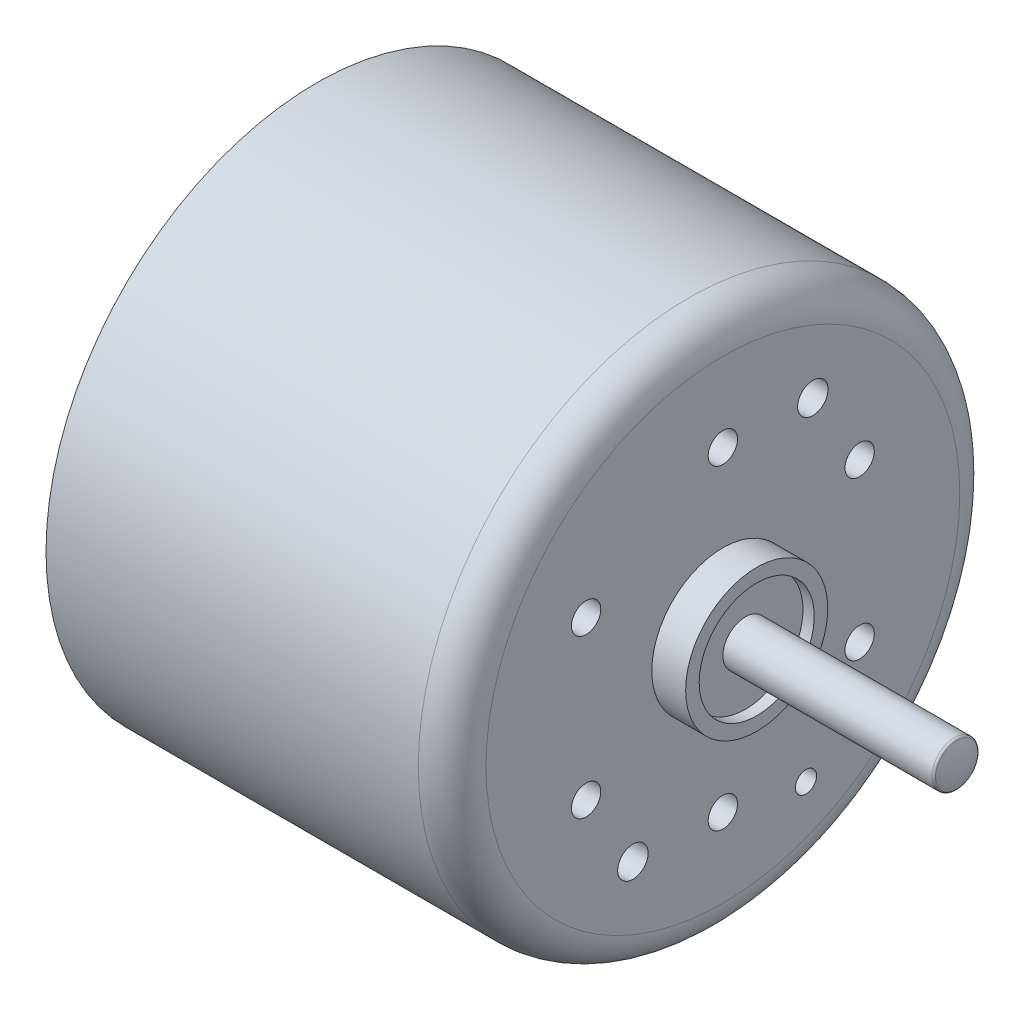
ISO-10303-21;
HEADER;
FILE_DESCRIPTION(('STEP AP214'),'2;1');
FILE_NAME('part.step','',(''),(''),'','','');
FILE_SCHEMA(('AUTOMOTIVE_DESIGN { 1 0 10303 214 1 1 1 1 }'));
ENDSEC;
DATA;
#1=APPLICATION_CONTEXT('core data for automotive mechanical design processes');
#2=APPLICATION_PROTOCOL_DEFINITION('international standard','automotive_design',2000,#1);
#3=PRODUCT_CONTEXT('',#1,'mechanical');
#4=PRODUCT('Part','Part','',(#3));
#5=PRODUCT_RELATED_PRODUCT_CATEGORY('part','',(#4));
#6=PRODUCT_DEFINITION_FORMATION('','',#4);
#7=PRODUCT_DEFINITION_CONTEXT('part definition',#1,'design');
#8=PRODUCT_DEFINITION('design','',#6,#7);
#9=PRODUCT_DEFINITION_SHAPE('','',#8);
#10=(LENGTH_UNIT() NAMED_UNIT(*) SI_UNIT(.MILLI.,.METRE.));
#11=(NAMED_UNIT(*) PLANE_ANGLE_UNIT() SI_UNIT($,.RADIAN.));
#12=(NAMED_UNIT(*) SI_UNIT($,.STERADIAN.) SOLID_ANGLE_UNIT());
#13=UNCERTAINTY_MEASURE_WITH_UNIT(LENGTH_MEASURE(1.E-05),#10,'distance_accuracy_value','');
#14=(GEOMETRIC_REPRESENTATION_CONTEXT(3) GLOBAL_UNCERTAINTY_ASSIGNED_CONTEXT((#13)) GLOBAL_UNIT_ASSIGNED_CONTEXT((#10,
#11,#12)) REPRESENTATION_CONTEXT('',''));
#15=CARTESIAN_POINT('',(0.,0.,0.));
#16=DIRECTION('',(0.,0.,1.));
#17=DIRECTION('',(1.,0.,0.));
#18=AXIS2_PLACEMENT_3D('',#15,#16,#17);
#19=CARTESIAN_POINT('',(30.268447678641,0.,0.));
#20=DIRECTION('',(-1.,0.,0.));
#21=DIRECTION('',(0.,0.,1.));
#22=AXIS2_PLACEMENT_3D('',#19,#20,#21);
#23=TOROIDAL_SURFACE('',#22,0.900000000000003,0.100000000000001);
#24=CARTESIAN_POINT('',(30.3623738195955,0.,0.));
#25=DIRECTION('',(-1.,0.,0.));
#26=DIRECTION('',(0.,0.,1.));
#27=AXIS2_PLACEMENT_3D('',#24,#25,#26);
#28=CIRCLE('',#27,0.934320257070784);
#29=CARTESIAN_POINT('',(30.3623738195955,0.,0.934320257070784));
#30=VERTEX_POINT('',#29);
#31=EDGE_CURVE('E11',#30,#30,#28,.T.);
#32=ORIENTED_EDGE('',*,*,#31,.T.);
#33=EDGE_LOOP('',(#32));
#34=FACE_BOUND('',#33,.T.);
#35=CARTESIAN_POINT('',(30.268447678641,0.,0.));
#36=DIRECTION('',(-1.,0.,0.));
#37=DIRECTION('',(0.,0.,1.));
#38=AXIS2_PLACEMENT_3D('',#35,#36,#37);
#39=CIRCLE('',#38,1.);
#40=CARTESIAN_POINT('',(30.268447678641,0.,1.));
#41=VERTEX_POINT('',#40);
#42=EDGE_CURVE('E46',#41,#41,#39,.T.);
#43=ORIENTED_EDGE('',*,*,#42,.F.);
#44=EDGE_LOOP('',(#43));
#45=FACE_BOUND('',#44,.T.);
#46=ADVANCED_FACE('F27',(#34,#45),#23,.T.);
#47=CARTESIAN_POINT('',(28.1738982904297,0.,0.134659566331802));
#48=DIRECTION('',(0.,-1.,0.));
#49=DIRECTION('',(0.,0.,1.));
#50=AXIS2_PLACEMENT_3D('',#47,#48,#49);
#51=CIRCLE('',#50,2.32999621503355);
#52=TRIMMED_CURVE('',#51,(PARAMETER_VALUE(-1.62862244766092)),
(PARAMETER_VALUE(1.62862244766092)),.T.,.PARAMETER.);
#53=CARTESIAN_POINT('',(28.1738982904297,0.,0.));
#54=DIRECTION('',(-1.,0.,0.));
#55=AXIS1_PLACEMENT('',#53,#54);
#56=SURFACE_OF_REVOLUTION('',#52,#55);
#57=CARTESIAN_POINT('',(30.5,0.,0.));
#58=VERTEX_POINT('',#57);
#59=VERTEX_LOOP('',#58);
#60=FACE_BOUND('',#59,.T.);
#61=ORIENTED_EDGE('',*,*,#31,.F.);
#62=EDGE_LOOP('',(#61));
#63=FACE_BOUND('',#62,.T.);
#64=ADVANCED_FACE('F36',(#60,#63),#56,.T.);
#65=CARTESIAN_POINT('',(0.,2.83104480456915,0.));
#66=DIRECTION('',(1.,0.,0.));
#67=DIRECTION('',(0.,0.,-1.));
#68=AXIS2_PLACEMENT_3D('',#65,#66,#67);
#69=PLANE('',#68);
#70=CARTESIAN_POINT('',(0.,0.,0.));
#71=DIRECTION('',(-1.,0.,0.));
#72=DIRECTION('',(0.,0.,1.));
#73=AXIS2_PLACEMENT_3D('',#70,#71,#72);
#74=CIRCLE('',#73,0.87340055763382);
#75=CARTESIAN_POINT('',(0.,0.,0.87340055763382));
#76=VERTEX_POINT('',#75);
#77=EDGE_CURVE('E33',#76,#76,#74,.T.);
#78=ORIENTED_EDGE('',*,*,#77,.T.);
#79=EDGE_LOOP('',(#78));
#80=FACE_BOUND('',#79,.T.);
#81=ADVANCED_FACE('F39',(#80),#69,.F.);
#82=CARTESIAN_POINT('',(5.38600510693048,0.,0.));
#83=DIRECTION('',(-1.,0.,0.));
#84=DIRECTION('',(0.,0.,1.));
#85=AXIS2_PLACEMENT_3D('',#82,#83,#84);
#86=DEGENERATE_TOROIDAL_SURFACE('',#85,0.436700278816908,5.4036800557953,.T.);
#87=CARTESIAN_POINT('',(0.592327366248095,0.,0.));
#88=DIRECTION('',(-1.,0.,0.));
#89=DIRECTION('',(0.,0.,1.));
#90=AXIS2_PLACEMENT_3D('',#87,#88,#89);
#91=CIRCLE('',#90,2.93077563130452);
#92=CARTESIAN_POINT('',(0.592327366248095,0.,2.93077563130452));
#93=VERTEX_POINT('',#92);
#94=EDGE_CURVE('E91',#93,#93,#91,.T.);
#95=ORIENTED_EDGE('',*,*,#94,.T.);
#96=EDGE_LOOP('',(#95));
#97=FACE_BOUND('',#96,.T.);
#98=ORIENTED_EDGE('',*,*,#77,.F.);
#99=EDGE_LOOP('',(#98));
#100=FACE_BOUND('',#99,.T.);
#101=ADVANCED_FACE('F97',(#97,#100),#86,.T.);
#102=CARTESIAN_POINT('',(1.03588413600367,0.,0.));
#103=DIRECTION('',(-1.,0.,0.));
#104=DIRECTION('',(0.,0.,1.));
#105=AXIS2_PLACEMENT_3D('',#102,#103,#104);
#106=TOROIDAL_SURFACE('',#105,2.7,0.5);
#107=ORIENTED_EDGE('',*,*,#94,.F.);
#108=EDGE_LOOP('',(#107));
#109=FACE_BOUND('',#108,.T.);
#110=CARTESIAN_POINT('',(1.03588413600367,0.,0.));
#111=DIRECTION('',(-1.,0.,0.));
#112=DIRECTION('',(0.,0.,1.));
#113=AXIS2_PLACEMENT_3D('',#110,#111,#112);
#114=CIRCLE('',#113,3.2);
#115=CARTESIAN_POINT('',(1.03588413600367,0.,3.2));
#116=VERTEX_POINT('',#115);
#117=EDGE_CURVE('E88',#116,#116,#114,.T.);
#118=ORIENTED_EDGE('',*,*,#117,.T.);
#119=EDGE_LOOP('',(#118));
#120=FACE_BOUND('',#119,.T.);
#121=ADVANCED_FACE('F99',(#109,#120),#106,.T.);
#122=CARTESIAN_POINT('',(0.,0.,0.));
#123=DIRECTION('',(-1.,0.,0.));
#124=DIRECTION('',(0.,0.,1.));
#125=AXIS2_PLACEMENT_3D('',#122,#123,#124);
#126=CYLINDRICAL_SURFACE('',#125,3.2);
#127=ORIENTED_EDGE('',*,*,#117,.F.);
#128=EDGE_LOOP('',(#127));
#129=FACE_BOUND('',#128,.T.);
#130=CARTESIAN_POINT('',(2.5,0.,0.));
#131=DIRECTION('',(-1.,0.,0.));
#132=DIRECTION('',(0.,0.,1.));
#133=AXIS2_PLACEMENT_3D('',#130,#131,#132);
#134=CIRCLE('',#133,3.2);
#135=CARTESIAN_POINT('',(2.5,0.,3.2));
#136=VERTEX_POINT('',#135);
#137=EDGE_CURVE('E85',#136,#136,#134,.T.);
#138=ORIENTED_EDGE('',*,*,#137,.T.);
#139=EDGE_LOOP('',(#138));
#140=FACE_BOUND('',#139,.T.);
#141=ADVANCED_FACE('F106',(#129,#140),#126,.T.);
#142=CARTESIAN_POINT('',(2.5,2.83104480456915,0.));
#143=DIRECTION('',(1.,0.,0.));
#144=DIRECTION('',(0.,0.,-1.));
#145=AXIS2_PLACEMENT_3D('',#142,#143,#144);
#146=PLANE('',#145);
#147=ORIENTED_EDGE('',*,*,#137,.F.);
#148=EDGE_LOOP('',(#147));
#149=FACE_BOUND('',#148,.T.);
#150=CARTESIAN_POINT('',(2.5,0.,0.));
#151=DIRECTION('',(-1.,0.,0.));
#152=DIRECTION('',(0.,0.,1.));
#153=AXIS2_PLACEMENT_3D('',#150,#151,#152);
#154=CIRCLE('',#153,11.4);
#155=CARTESIAN_POINT('',(2.5,0.,11.4));
#156=VERTEX_POINT('',#155);
#157=EDGE_CURVE('E82',#156,#156,#154,.T.);
#158=ORIENTED_EDGE('',*,*,#157,.T.);
#159=EDGE_LOOP('',(#158));
#160=FACE_BOUND('',#159,.T.);
#161=ADVANCED_FACE('F113',(#149,#160),#146,.F.);
#162=CARTESIAN_POINT('',(0.,0.,0.));
#163=DIRECTION('',(-1.,0.,0.));
#164=DIRECTION('',(0.,0.,1.));
#165=AXIS2_PLACEMENT_3D('',#162,#163,#164);
#166=CYLINDRICAL_SURFACE('',#165,11.4);
#167=ORIENTED_EDGE('',*,*,#157,.F.);
#168=EDGE_LOOP('',(#167));
#169=FACE_BOUND('',#168,.T.);
#170=CARTESIAN_POINT('',(2.,0.,0.));
#171=DIRECTION('',(-1.,0.,0.));
#172=DIRECTION('',(0.,0.,1.));
#173=AXIS2_PLACEMENT_3D('',#170,#171,#172);
#174=CIRCLE('',#173,11.4);
#175=CARTESIAN_POINT('',(2.,0.,11.4));
#176=VERTEX_POINT('',#175);
#177=EDGE_CURVE('E79',#176,#176,#174,.T.);
#178=ORIENTED_EDGE('',*,*,#177,.T.);
#179=EDGE_LOOP('',(#178));
#180=FACE_BOUND('',#179,.T.);
#181=ADVANCED_FACE('F117',(#169,#180),#166,.F.);
#182=CARTESIAN_POINT('',(2.,2.83104480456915,0.));
#183=DIRECTION('',(1.,0.,0.));
#184=DIRECTION('',(0.,0.,-1.));
#185=AXIS2_PLACEMENT_3D('',#182,#183,#184);
#186=PLANE('',#185);
#187=ORIENTED_EDGE('',*,*,#177,.F.);
#188=EDGE_LOOP('',(#187));
#189=FACE_BOUND('',#188,.T.);
#190=CARTESIAN_POINT('',(2.,0.,0.));
#191=DIRECTION('',(-1.,0.,0.));
#192=DIRECTION('',(0.,0.,1.));
#193=AXIS2_PLACEMENT_3D('',#190,#191,#192);
#194=CIRCLE('',#193,12.);
#195=CARTESIAN_POINT('',(2.,0.,12.));
#196=VERTEX_POINT('',#195);
#197=EDGE_CURVE('E76',#196,#196,#194,.T.);
#198=ORIENTED_EDGE('',*,*,#197,.T.);
#199=EDGE_LOOP('',(#198));
#200=FACE_BOUND('',#199,.T.);
#201=ADVANCED_FACE('F121',(#189,#200),#186,.F.);
#202=CARTESIAN_POINT('',(0.,0.,0.));
#203=DIRECTION('',(-1.,0.,0.));
#204=DIRECTION('',(0.,0.,1.));
#205=AXIS2_PLACEMENT_3D('',#202,#203,#204);
#206=CYLINDRICAL_SURFACE('',#205,12.);
#207=ORIENTED_EDGE('',*,*,#197,.F.);
#208=EDGE_LOOP('',(#207));
#209=FACE_BOUND('',#208,.T.);
#210=CARTESIAN_POINT('',(18.5,0.,0.));
#211=DIRECTION('',(-1.,0.,0.));
#212=DIRECTION('',(0.,0.,1.));
#213=AXIS2_PLACEMENT_3D('',#210,#211,#212);
#214=CIRCLE('',#213,12.);
#215=CARTESIAN_POINT('',(18.5,0.,12.));
#216=VERTEX_POINT('',#215);
#217=EDGE_CURVE('E73',#216,#216,#214,.T.);
#218=ORIENTED_EDGE('',*,*,#217,.T.);
#219=EDGE_LOOP('',(#218));
#220=FACE_BOUND('',#219,.T.);
#221=ADVANCED_FACE('F125',(#209,#220),#206,.T.);
#222=CARTESIAN_POINT('',(18.5,0.,0.));
#223=DIRECTION('',(-1.,0.,0.));
#224=DIRECTION('',(0.,0.,1.));
#225=AXIS2_PLACEMENT_3D('',#222,#223,#224);
#226=TOROIDAL_SURFACE('',#225,10.5,1.5);
#227=CARTESIAN_POINT('',(20.,0.,0.));
#228=DIRECTION('',(-1.,0.,0.));
#229=DIRECTION('',(0.,0.,1.));
#230=AXIS2_PLACEMENT_3D('',#227,#228,#229);
#231=CIRCLE('',#230,10.5);
#232=CARTESIAN_POINT('',(20.,0.,10.5));
#233=VERTEX_POINT('',#232);
#234=EDGE_CURVE('E70',#233,#233,#231,.T.);
#235=ORIENTED_EDGE('',*,*,#234,.T.);
#236=EDGE_LOOP('',(#235));
#237=FACE_BOUND('',#236,.T.);
#238=ORIENTED_EDGE('',*,*,#217,.F.);
#239=EDGE_LOOP('',(#238));
#240=FACE_BOUND('',#239,.T.);
#241=ADVANCED_FACE('F129',(#237,#240),#226,.T.);
#242=CARTESIAN_POINT('',(20.,2.83104480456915,0.));
#243=DIRECTION('',(-1.,0.,0.));
#244=DIRECTION('',(0.,0.,1.));
#245=AXIS2_PLACEMENT_3D('',#242,#243,#244);
#246=PLANE('',#245);
#247=CARTESIAN_POINT('',(20.,-7.67489330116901,-3.68322302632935));
#248=DIRECTION('',(1.,0.,0.));
#249=DIRECTION('',(0.,0.,-1.));
#250=AXIS2_PLACEMENT_3D('',#247,#248,#249);
#251=CIRCLE('',#250,0.471742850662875);
#252=CARTESIAN_POINT('',(20.,-7.67489330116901,-4.15496587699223));
#253=VERTEX_POINT('',#252);
#254=EDGE_CURVE('E235',#253,#253,#251,.T.);
#255=ORIENTED_EDGE('',*,*,#254,.F.);
#256=EDGE_LOOP('',(#255));
#257=FACE_BOUND('',#256,.T.);
#258=CARTESIAN_POINT('',(20.,-6.9065525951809,3.98749999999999));
#259=DIRECTION('',(1.,0.,0.));
#260=DIRECTION('',(0.,0.,1.));
#261=AXIS2_PLACEMENT_3D('',#258,#259,#260);
#262=CIRCLE('',#261,0.675);
#263=CARTESIAN_POINT('',(20.,-6.9065525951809,4.66249999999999));
#264=VERTEX_POINT('',#263);
#265=EDGE_CURVE('E234',#264,#264,#262,.T.);
#266=ORIENTED_EDGE('',*,*,#265,.F.);
#267=EDGE_LOOP('',(#266));
#268=FACE_BOUND('',#267,.T.);
#269=CARTESIAN_POINT('',(20.,6.9065525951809,-3.9875));
#270=DIRECTION('',(1.,0.,0.));
#271=DIRECTION('',(0.,0.,-1.));
#272=AXIS2_PLACEMENT_3D('',#269,#270,#271);
#273=CIRCLE('',#272,0.675000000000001);
#274=CARTESIAN_POINT('',(20.,6.9065525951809,-4.6625));
#275=VERTEX_POINT('',#274);
#276=EDGE_CURVE('E245',#275,#275,#273,.T.);
#277=ORIENTED_EDGE('',*,*,#276,.F.);
#278=EDGE_LOOP('',(#277));
#279=FACE_BOUND('',#278,.T.);
#280=CARTESIAN_POINT('',(20.,3.50000000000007,6.06217782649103));
#281=DIRECTION('',(1.,0.,0.));
#282=DIRECTION('',(0.,0.,-1.));
#283=AXIS2_PLACEMENT_3D('',#280,#281,#282);
#284=CIRCLE('',#283,0.65);
#285=CARTESIAN_POINT('',(20.,3.50000000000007,5.41217782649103));
#286=VERTEX_POINT('',#285);
#287=EDGE_CURVE('E251',#286,#286,#284,.T.);
#288=ORIENTED_EDGE('',*,*,#287,.F.);
#289=EDGE_LOOP('',(#288));
#290=FACE_BOUND('',#289,.T.);
#291=CARTESIAN_POINT('',(20.,-3.49999999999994,6.06217782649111));
#292=DIRECTION('',(1.,0.,0.));
#293=DIRECTION('',(0.,0.,-1.));
#294=AXIS2_PLACEMENT_3D('',#291,#292,#293);
#295=CIRCLE('',#294,0.65);
#296=CARTESIAN_POINT('',(20.,-3.49999999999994,5.4121778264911));
#297=VERTEX_POINT('',#296);
#298=EDGE_CURVE('E257',#297,#297,#295,.T.);
#299=ORIENTED_EDGE('',*,*,#298,.F.);
#300=EDGE_LOOP('',(#299));
#301=FACE_BOUND('',#300,.T.);
#302=CARTESIAN_POINT('',(20.,-7.,0.));
#303=DIRECTION('',(1.,0.,0.));
#304=DIRECTION('',(0.,0.,-1.));
#305=AXIS2_PLACEMENT_3D('',#302,#303,#304);
#306=CIRCLE('',#305,0.65);
#307=CARTESIAN_POINT('',(20.,-7.,-0.649999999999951));
#308=VERTEX_POINT('',#307);
#309=EDGE_CURVE('E263',#308,#308,#306,.T.);
#310=ORIENTED_EDGE('',*,*,#309,.F.);
#311=EDGE_LOOP('',(#310));
#312=FACE_BOUND('',#311,.T.);
#313=CARTESIAN_POINT('',(20.,-3.50000000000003,-6.06217782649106));
#314=DIRECTION('',(1.,0.,0.));
#315=DIRECTION('',(0.,0.,-1.));
#316=AXIS2_PLACEMENT_3D('',#313,#314,#315);
#317=CIRCLE('',#316,0.65);
#318=CARTESIAN_POINT('',(20.,-3.50000000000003,-6.71217782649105));
#319=VERTEX_POINT('',#318);
#320=EDGE_CURVE('E269',#319,#319,#317,.T.);
#321=ORIENTED_EDGE('',*,*,#320,.F.);
#322=EDGE_LOOP('',(#321));
#323=FACE_BOUND('',#322,.T.);
#324=CARTESIAN_POINT('',(20.,3.49999999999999,-6.06217782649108));
#325=DIRECTION('',(1.,0.,0.));
#326=DIRECTION('',(0.,0.,-1.));
#327=AXIS2_PLACEMENT_3D('',#324,#325,#326);
#328=CIRCLE('',#327,0.65);
#329=CARTESIAN_POINT('',(20.,3.49999999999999,-6.71217782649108));
#330=VERTEX_POINT('',#329);
#331=EDGE_CURVE('E275',#330,#330,#328,.T.);
#332=ORIENTED_EDGE('',*,*,#331,.F.);
#333=EDGE_LOOP('',(#332));
#334=FACE_BOUND('',#333,.T.);
#335=CARTESIAN_POINT('',(20.,7.,0.));
#336=DIRECTION('',(1.,0.,0.));
#337=DIRECTION('',(0.,0.,-1.));
#338=AXIS2_PLACEMENT_3D('',#335,#336,#337);
#339=CIRCLE('',#338,0.65);
#340=CARTESIAN_POINT('',(20.,7.,-0.65));
#341=VERTEX_POINT('',#340);
#342=EDGE_CURVE('E55',#341,#341,#339,.T.);
#343=ORIENTED_EDGE('',*,*,#342,.F.);
#344=EDGE_LOOP('',(#343));
#345=FACE_BOUND('',#344,.T.);
#346=ORIENTED_EDGE('',*,*,#234,.F.);
#347=EDGE_LOOP('',(#346));
#348=FACE_BOUND('',#347,.T.);
#349=CARTESIAN_POINT('',(20.,0.,0.));
#350=DIRECTION('',(-1.,0.,0.));
#351=DIRECTION('',(0.,0.,1.));
#352=AXIS2_PLACEMENT_3D('',#349,#350,#351);
#353=CIRCLE('',#352,3.14999999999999);
#354=CARTESIAN_POINT('',(20.,0.,3.14999999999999));
#355=VERTEX_POINT('',#354);
#356=EDGE_CURVE('E67',#355,#355,#353,.T.);
#357=ORIENTED_EDGE('',*,*,#356,.T.);
#358=EDGE_LOOP('',(#357));
#359=FACE_BOUND('',#358,.T.);
#360=ADVANCED_FACE('F133',(#257,#268,#279,#290,#301,#312,#323,#334,#345,#348,#359),#246,.F.);
#361=CARTESIAN_POINT('',(0.,0.,0.));
#362=DIRECTION('',(-1.,0.,0.));
#363=DIRECTION('',(0.,0.,1.));
#364=AXIS2_PLACEMENT_3D('',#361,#362,#363);
#365=CYLINDRICAL_SURFACE('',#364,3.14999999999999);
#366=ORIENTED_EDGE('',*,*,#356,.F.);
#367=EDGE_LOOP('',(#366));
#368=FACE_BOUND('',#367,.T.);
#369=CARTESIAN_POINT('',(21.5,0.,0.));
#370=DIRECTION('',(-1.,0.,0.));
#371=DIRECTION('',(0.,0.,1.));
#372=AXIS2_PLACEMENT_3D('',#369,#370,#371);
#373=CIRCLE('',#372,3.14999999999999);
#374=CARTESIAN_POINT('',(21.5,0.,3.14999999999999));
#375=VERTEX_POINT('',#374);
#376=EDGE_CURVE('E64',#375,#375,#373,.T.);
#377=ORIENTED_EDGE('',*,*,#376,.T.);
#378=EDGE_LOOP('',(#377));
#379=FACE_BOUND('',#378,.T.);
#380=ADVANCED_FACE('F137',(#368,#379),#365,.T.);
#381=CARTESIAN_POINT('',(21.5,2.83104480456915,0.));
#382=DIRECTION('',(-1.,0.,0.));
#383=DIRECTION('',(0.,0.,1.));
#384=AXIS2_PLACEMENT_3D('',#381,#382,#383);
#385=PLANE('',#384);
#386=ORIENTED_EDGE('',*,*,#376,.F.);
#387=EDGE_LOOP('',(#386));
#388=FACE_BOUND('',#387,.T.);
#389=CARTESIAN_POINT('',(21.5,0.,0.));
#390=DIRECTION('',(-1.,0.,0.));
#391=DIRECTION('',(0.,0.,1.));
#392=AXIS2_PLACEMENT_3D('',#389,#390,#391);
#393=CIRCLE('',#392,2.54999999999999);
#394=CARTESIAN_POINT('',(21.5,0.,2.54999999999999));
#395=VERTEX_POINT('',#394);
#396=EDGE_CURVE('E61',#395,#395,#393,.T.);
#397=ORIENTED_EDGE('',*,*,#396,.T.);
#398=EDGE_LOOP('',(#397));
#399=FACE_BOUND('',#398,.T.);
#400=ADVANCED_FACE('F141',(#388,#399),#385,.F.);
#401=CARTESIAN_POINT('',(0.,0.,0.));
#402=DIRECTION('',(-1.,0.,0.));
#403=DIRECTION('',(0.,0.,1.));
#404=AXIS2_PLACEMENT_3D('',#401,#402,#403);
#405=CYLINDRICAL_SURFACE('',#404,2.54999999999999);
#406=ORIENTED_EDGE('',*,*,#396,.F.);
#407=EDGE_LOOP('',(#406));
#408=FACE_BOUND('',#407,.T.);
#409=CARTESIAN_POINT('',(21.,0.,0.));
#410=DIRECTION('',(-1.,0.,0.));
#411=DIRECTION('',(0.,0.,1.));
#412=AXIS2_PLACEMENT_3D('',#409,#410,#411);
#413=CIRCLE('',#412,2.54999999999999);
#414=CARTESIAN_POINT('',(21.,0.,2.54999999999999));
#415=VERTEX_POINT('',#414);
#416=EDGE_CURVE('E52',#415,#415,#413,.T.);
#417=ORIENTED_EDGE('',*,*,#416,.T.);
#418=EDGE_LOOP('',(#417));
#419=FACE_BOUND('',#418,.T.);
#420=ADVANCED_FACE('F145',(#408,#419),#405,.F.);
#421=CARTESIAN_POINT('',(21.,2.83104480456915,0.));
#422=DIRECTION('',(-1.,0.,0.));
#423=DIRECTION('',(0.,0.,1.));
#424=AXIS2_PLACEMENT_3D('',#421,#422,#423);
#425=PLANE('',#424);
#426=ORIENTED_EDGE('',*,*,#416,.F.);
#427=EDGE_LOOP('',(#426));
#428=FACE_BOUND('',#427,.T.);
#429=CARTESIAN_POINT('',(21.,0.,0.));
#430=DIRECTION('',(-1.,0.,0.));
#431=DIRECTION('',(0.,0.,1.));
#432=AXIS2_PLACEMENT_3D('',#429,#430,#431);
#433=CIRCLE('',#432,0.999999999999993);
#434=CARTESIAN_POINT('',(21.,0.,0.999999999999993));
#435=VERTEX_POINT('',#434);
#436=EDGE_CURVE('E48',#435,#435,#433,.T.);
#437=ORIENTED_EDGE('',*,*,#436,.T.);
#438=EDGE_LOOP('',(#437));
#439=FACE_BOUND('',#438,.T.);
#440=ADVANCED_FACE('F149',(#428,#439),#425,.F.);
#441=CARTESIAN_POINT('',(0.,0.,0.));
#442=DIRECTION('',(-1.,0.,0.));
#443=DIRECTION('',(0.,0.,1.));
#444=AXIS2_PLACEMENT_3D('',#441,#442,#443);
#445=CYLINDRICAL_SURFACE('',#444,0.999999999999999);
#446=ORIENTED_EDGE('',*,*,#436,.F.);
#447=EDGE_LOOP('',(#446));
#448=FACE_BOUND('',#447,.T.);
#449=ORIENTED_EDGE('',*,*,#42,.T.);
#450=EDGE_LOOP('',(#449));
#451=FACE_BOUND('',#450,.T.);
#452=ADVANCED_FACE('F153',(#448,#451),#445,.T.);
#453=CARTESIAN_POINT('',(17.,7.,0.));
#454=DIRECTION('',(1.,0.,0.));
#455=DIRECTION('',(0.,0.,-1.));
#456=AXIS2_PLACEMENT_3D('',#453,#454,#455);
#457=CYLINDRICAL_SURFACE('',#456,0.65);
#458=CARTESIAN_POINT('',(17.,7.,0.));
#459=DIRECTION('',(1.,0.,0.));
#460=DIRECTION('',(0.,0.,-1.));
#461=AXIS2_PLACEMENT_3D('',#458,#459,#460);
#462=CIRCLE('',#461,0.65);
#463=CARTESIAN_POINT('',(17.,7.,-0.65));
#464=VERTEX_POINT('',#463);
#465=EDGE_CURVE('E49',#464,#464,#462,.T.);
#466=ORIENTED_EDGE('',*,*,#465,.F.);
#467=EDGE_LOOP('',(#466));
#468=FACE_BOUND('',#467,.T.);
#469=ORIENTED_EDGE('',*,*,#342,.T.);
#470=EDGE_LOOP('',(#469));
#471=FACE_BOUND('',#470,.T.);
#472=ADVANCED_FACE('F157',(#468,#471),#457,.F.);
#473=CARTESIAN_POINT('',(17.,7.,0.));
#474=DIRECTION('',(1.,0.,0.));
#475=DIRECTION('',(0.,0.,-1.));
#476=AXIS2_PLACEMENT_3D('',#473,#474,#475);
#477=PLANE('',#476);
#478=ORIENTED_EDGE('',*,*,#465,.T.);
#479=EDGE_LOOP('',(#478));
#480=FACE_BOUND('',#479,.T.);
#481=ADVANCED_FACE('F161',(#480),#477,.T.);
#482=CARTESIAN_POINT('',(17.,3.49999999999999,-6.06217782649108));
#483=DIRECTION('',(1.,0.,0.));
#484=DIRECTION('',(0.,0.,-1.));
#485=AXIS2_PLACEMENT_3D('',#482,#483,#484);
#486=CYLINDRICAL_SURFACE('',#485,0.65);
#487=CARTESIAN_POINT('',(17.,3.49999999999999,-6.06217782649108));
#488=DIRECTION('',(1.,0.,0.));
#489=DIRECTION('',(0.,0.,-1.));
#490=AXIS2_PLACEMENT_3D('',#487,#488,#489);
#491=CIRCLE('',#490,0.65);
#492=CARTESIAN_POINT('',(17.,3.49999999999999,-6.71217782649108));
#493=VERTEX_POINT('',#492);
#494=EDGE_CURVE('E278',#493,#493,#491,.T.);
#495=ORIENTED_EDGE('',*,*,#494,.F.);
#496=EDGE_LOOP('',(#495));
#497=FACE_BOUND('',#496,.T.);
#498=ORIENTED_EDGE('',*,*,#331,.T.);
#499=EDGE_LOOP('',(#498));
#500=FACE_BOUND('',#499,.T.);
#501=ADVANCED_FACE('F165',(#497,#500),#486,.F.);
#502=CARTESIAN_POINT('',(17.,3.49999999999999,-6.06217782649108));
#503=DIRECTION('',(1.,0.,0.));
#504=DIRECTION('',(0.,0.,-1.));
#505=AXIS2_PLACEMENT_3D('',#502,#503,#504);
#506=PLANE('',#505);
#507=ORIENTED_EDGE('',*,*,#494,.T.);
#508=EDGE_LOOP('',(#507));
#509=FACE_BOUND('',#508,.T.);
#510=ADVANCED_FACE('F169',(#509),#506,.T.);
#511=CARTESIAN_POINT('',(17.,-3.50000000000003,-6.06217782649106));
#512=DIRECTION('',(1.,0.,0.));
#513=DIRECTION('',(0.,0.,-1.));
#514=AXIS2_PLACEMENT_3D('',#511,#512,#513);
#515=CYLINDRICAL_SURFACE('',#514,0.65);
#516=CARTESIAN_POINT('',(17.,-3.50000000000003,-6.06217782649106));
#517=DIRECTION('',(1.,0.,0.));
#518=DIRECTION('',(0.,0.,-1.));
#519=AXIS2_PLACEMENT_3D('',#516,#517,#518);
#520=CIRCLE('',#519,0.65);
#521=CARTESIAN_POINT('',(17.,-3.50000000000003,-6.71217782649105));
#522=VERTEX_POINT('',#521);
#523=EDGE_CURVE('E272',#522,#522,#520,.T.);
#524=ORIENTED_EDGE('',*,*,#523,.F.);
#525=EDGE_LOOP('',(#524));
#526=FACE_BOUND('',#525,.T.);
#527=ORIENTED_EDGE('',*,*,#320,.T.);
#528=EDGE_LOOP('',(#527));
#529=FACE_BOUND('',#528,.T.);
#530=ADVANCED_FACE('F173',(#526,#529),#515,.F.);
#531=CARTESIAN_POINT('',(17.,-3.50000000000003,-6.06217782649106));
#532=DIRECTION('',(1.,0.,0.));
#533=DIRECTION('',(0.,0.,-1.));
#534=AXIS2_PLACEMENT_3D('',#531,#532,#533);
#535=PLANE('',#534);
#536=ORIENTED_EDGE('',*,*,#523,.T.);
#537=EDGE_LOOP('',(#536));
#538=FACE_BOUND('',#537,.T.);
#539=ADVANCED_FACE('F177',(#538),#535,.T.);
#540=CARTESIAN_POINT('',(17.,-7.,0.));
#541=DIRECTION('',(1.,0.,0.));
#542=DIRECTION('',(0.,0.,-1.));
#543=AXIS2_PLACEMENT_3D('',#540,#541,#542);
#544=CYLINDRICAL_SURFACE('',#543,0.65);
#545=CARTESIAN_POINT('',(17.,-7.,0.));
#546=DIRECTION('',(1.,0.,0.));
#547=DIRECTION('',(0.,0.,-1.));
#548=AXIS2_PLACEMENT_3D('',#545,#546,#547);
#549=CIRCLE('',#548,0.65);
#550=CARTESIAN_POINT('',(17.,-7.,-0.649999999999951));
#551=VERTEX_POINT('',#550);
#552=EDGE_CURVE('E266',#551,#551,#549,.T.);
#553=ORIENTED_EDGE('',*,*,#552,.F.);
#554=EDGE_LOOP('',(#553));
#555=FACE_BOUND('',#554,.T.);
#556=ORIENTED_EDGE('',*,*,#309,.T.);
#557=EDGE_LOOP('',(#556));
#558=FACE_BOUND('',#557,.T.);
#559=ADVANCED_FACE('F181',(#555,#558),#544,.F.);
#560=CARTESIAN_POINT('',(17.,-7.,0.));
#561=DIRECTION('',(1.,0.,0.));
#562=DIRECTION('',(0.,0.,-1.));
#563=AXIS2_PLACEMENT_3D('',#560,#561,#562);
#564=PLANE('',#563);
#565=ORIENTED_EDGE('',*,*,#552,.T.);
#566=EDGE_LOOP('',(#565));
#567=FACE_BOUND('',#566,.T.);
#568=ADVANCED_FACE('F185',(#567),#564,.T.);
#569=CARTESIAN_POINT('',(17.,-3.49999999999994,6.06217782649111));
#570=DIRECTION('',(1.,0.,0.));
#571=DIRECTION('',(0.,0.,-1.));
#572=AXIS2_PLACEMENT_3D('',#569,#570,#571);
#573=CYLINDRICAL_SURFACE('',#572,0.65);
#574=CARTESIAN_POINT('',(17.,-3.49999999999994,6.06217782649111));
#575=DIRECTION('',(1.,0.,0.));
#576=DIRECTION('',(0.,0.,-1.));
#577=AXIS2_PLACEMENT_3D('',#574,#575,#576);
#578=CIRCLE('',#577,0.65);
#579=CARTESIAN_POINT('',(17.,-3.49999999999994,5.4121778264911));
#580=VERTEX_POINT('',#579);
#581=EDGE_CURVE('E260',#580,#580,#578,.T.);
#582=ORIENTED_EDGE('',*,*,#581,.F.);
#583=EDGE_LOOP('',(#582));
#584=FACE_BOUND('',#583,.T.);
#585=ORIENTED_EDGE('',*,*,#298,.T.);
#586=EDGE_LOOP('',(#585));
#587=FACE_BOUND('',#586,.T.);
#588=ADVANCED_FACE('F189',(#584,#587),#573,.F.);
#589=CARTESIAN_POINT('',(17.,-3.49999999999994,6.06217782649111));
#590=DIRECTION('',(1.,0.,0.));
#591=DIRECTION('',(0.,0.,-1.));
#592=AXIS2_PLACEMENT_3D('',#589,#590,#591);
#593=PLANE('',#592);
#594=ORIENTED_EDGE('',*,*,#581,.T.);
#595=EDGE_LOOP('',(#594));
#596=FACE_BOUND('',#595,.T.);
#597=ADVANCED_FACE('F193',(#596),#593,.T.);
#598=CARTESIAN_POINT('',(17.,3.50000000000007,6.06217782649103));
#599=DIRECTION('',(1.,0.,0.));
#600=DIRECTION('',(0.,0.,-1.));
#601=AXIS2_PLACEMENT_3D('',#598,#599,#600);
#602=CYLINDRICAL_SURFACE('',#601,0.65);
#603=CARTESIAN_POINT('',(17.,3.50000000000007,6.06217782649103));
#604=DIRECTION('',(1.,0.,0.));
#605=DIRECTION('',(0.,0.,-1.));
#606=AXIS2_PLACEMENT_3D('',#603,#604,#605);
#607=CIRCLE('',#606,0.65);
#608=CARTESIAN_POINT('',(17.,3.50000000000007,5.41217782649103));
#609=VERTEX_POINT('',#608);
#610=EDGE_CURVE('E254',#609,#609,#607,.T.);
#611=ORIENTED_EDGE('',*,*,#610,.F.);
#612=EDGE_LOOP('',(#611));
#613=FACE_BOUND('',#612,.T.);
#614=ORIENTED_EDGE('',*,*,#287,.T.);
#615=EDGE_LOOP('',(#614));
#616=FACE_BOUND('',#615,.T.);
#617=ADVANCED_FACE('F197',(#613,#616),#602,.F.);
#618=CARTESIAN_POINT('',(17.,3.50000000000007,6.06217782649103));
#619=DIRECTION('',(1.,0.,0.));
#620=DIRECTION('',(0.,0.,-1.));
#621=AXIS2_PLACEMENT_3D('',#618,#619,#620);
#622=PLANE('',#621);
#623=ORIENTED_EDGE('',*,*,#610,.T.);
#624=EDGE_LOOP('',(#623));
#625=FACE_BOUND('',#624,.T.);
#626=ADVANCED_FACE('F201',(#625),#622,.T.);
#627=CARTESIAN_POINT('',(17.,6.9065525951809,-3.9875));
#628=DIRECTION('',(1.,0.,0.));
#629=DIRECTION('',(0.,0.,-1.));
#630=AXIS2_PLACEMENT_3D('',#627,#628,#629);
#631=CYLINDRICAL_SURFACE('',#630,0.675000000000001);
#632=CARTESIAN_POINT('',(17.,6.9065525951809,-3.9875));
#633=DIRECTION('',(1.,0.,0.));
#634=DIRECTION('',(0.,0.,-1.));
#635=AXIS2_PLACEMENT_3D('',#632,#633,#634);
#636=CIRCLE('',#635,0.675000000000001);
#637=CARTESIAN_POINT('',(17.,6.9065525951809,-4.6625));
#638=VERTEX_POINT('',#637);
#639=EDGE_CURVE('E248',#638,#638,#636,.T.);
#640=ORIENTED_EDGE('',*,*,#639,.F.);
#641=EDGE_LOOP('',(#640));
#642=FACE_BOUND('',#641,.T.);
#643=ORIENTED_EDGE('',*,*,#276,.T.);
#644=EDGE_LOOP('',(#643));
#645=FACE_BOUND('',#644,.T.);
#646=ADVANCED_FACE('F205',(#642,#645),#631,.F.);
#647=CARTESIAN_POINT('',(17.,6.9065525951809,-3.9875));
#648=DIRECTION('',(1.,0.,0.));
#649=DIRECTION('',(0.,0.,-1.));
#650=AXIS2_PLACEMENT_3D('',#647,#648,#649);
#651=PLANE('',#650);
#652=ORIENTED_EDGE('',*,*,#639,.T.);
#653=EDGE_LOOP('',(#652));
#654=FACE_BOUND('',#653,.T.);
#655=ADVANCED_FACE('F209',(#654),#651,.T.);
#656=CARTESIAN_POINT('',(17.,-6.9065525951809,3.98749999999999));
#657=DIRECTION('',(1.,0.,0.));
#658=DIRECTION('',(0.,0.,-1.));
#659=AXIS2_PLACEMENT_3D('',#656,#657,#658);
#660=CYLINDRICAL_SURFACE('',#659,0.675);
#661=CARTESIAN_POINT('',(17.,-6.9065525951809,3.98749999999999));
#662=DIRECTION('',(1.,0.,0.));
#663=DIRECTION('',(0.,0.,1.));
#664=AXIS2_PLACEMENT_3D('',#661,#662,#663);
#665=CIRCLE('',#664,0.675);
#666=CARTESIAN_POINT('',(17.,-6.9065525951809,4.66249999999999));
#667=VERTEX_POINT('',#666);
#668=EDGE_CURVE('E238',#667,#667,#665,.T.);
#669=ORIENTED_EDGE('',*,*,#668,.F.);
#670=EDGE_LOOP('',(#669));
#671=FACE_BOUND('',#670,.T.);
#672=ORIENTED_EDGE('',*,*,#265,.T.);
#673=EDGE_LOOP('',(#672));
#674=FACE_BOUND('',#673,.T.);
#675=ADVANCED_FACE('F213',(#671,#674),#660,.F.);
#676=CARTESIAN_POINT('',(17.,-6.9065525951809,3.98749999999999));
#677=DIRECTION('',(-1.,0.,0.));
#678=DIRECTION('',(0.,0.,1.));
#679=AXIS2_PLACEMENT_3D('',#676,#677,#678);
#680=PLANE('',#679);
#681=ORIENTED_EDGE('',*,*,#668,.T.);
#682=EDGE_LOOP('',(#681));
#683=FACE_BOUND('',#682,.T.);
#684=ADVANCED_FACE('F217',(#683),#680,.F.);
#685=CARTESIAN_POINT('',(17.,-7.67489330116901,-3.68322302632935));
#686=DIRECTION('',(1.,0.,0.));
#687=DIRECTION('',(0.,0.,-1.));
#688=AXIS2_PLACEMENT_3D('',#685,#686,#687);
#689=CYLINDRICAL_SURFACE('',#688,0.471742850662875);
#690=CARTESIAN_POINT('',(17.,-7.67489330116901,-3.68322302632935));
#691=DIRECTION('',(1.,0.,0.));
#692=DIRECTION('',(0.,0.,-1.));
#693=AXIS2_PLACEMENT_3D('',#690,#691,#692);
#694=CIRCLE('',#693,0.471742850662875);
#695=CARTESIAN_POINT('',(17.,-7.67489330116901,-4.15496587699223));
#696=VERTEX_POINT('',#695);
#697=EDGE_CURVE('E233',#696,#696,#694,.T.);
#698=ORIENTED_EDGE('',*,*,#697,.F.);
#699=EDGE_LOOP('',(#698));
#700=FACE_BOUND('',#699,.T.);
#701=ORIENTED_EDGE('',*,*,#254,.T.);
#702=EDGE_LOOP('',(#701));
#703=FACE_BOUND('',#702,.T.);
#704=ADVANCED_FACE('F221',(#700,#703),#689,.F.);
#705=CARTESIAN_POINT('',(17.,-7.67489330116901,-3.68322302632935));
#706=DIRECTION('',(1.,0.,0.));
#707=DIRECTION('',(0.,0.,-1.));
#708=AXIS2_PLACEMENT_3D('',#705,#706,#707);
#709=PLANE('',#708);
#710=ORIENTED_EDGE('',*,*,#697,.T.);
#711=EDGE_LOOP('',(#710));
#712=FACE_BOUND('',#711,.T.);
#713=ADVANCED_FACE('F225',(#712),#709,.T.);
#714=CLOSED_SHELL('',(#46,#64,#81,#101,#121,#141,#161,#181,#201,#221,#241,#360,#380,#400,#420,
#440,#452,#472,#481,#501,#510,#530,#539,#559,#568,#588,#597,#617,#626,#646,#655,#675,#684,#704,#713));
#715=MANIFOLD_SOLID_BREP('B2',#714);
#716=ADVANCED_BREP_SHAPE_REPRESENTATION('',(#18,#715),#14);
#717=SHAPE_DEFINITION_REPRESENTATION(#9,#716);
ENDSEC;
END-ISO-10303-21;
